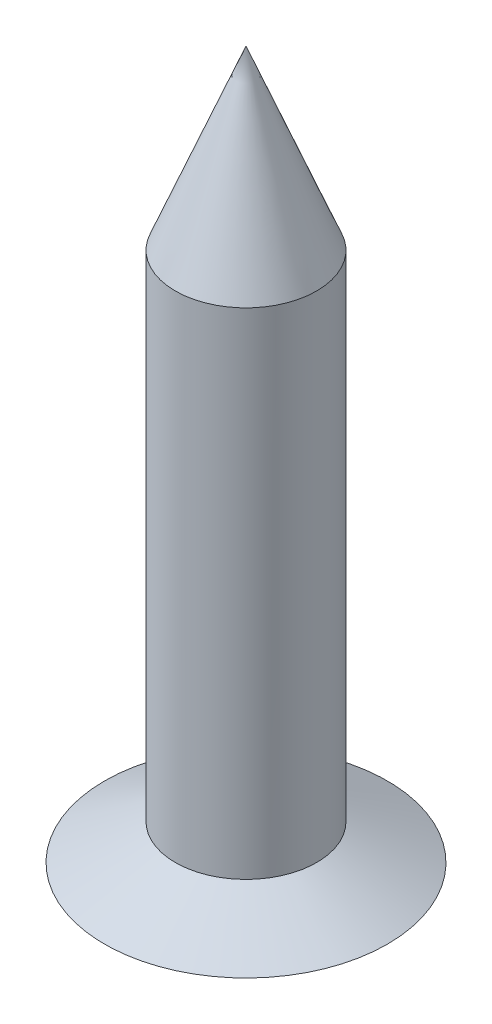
ISO-10303-21;
HEADER;
FILE_DESCRIPTION(('STEP AP214'),'2;1');
FILE_NAME('part.step','',(''),(''),'','','');
FILE_SCHEMA(('AUTOMOTIVE_DESIGN { 1 0 10303 214 1 1 1 1 }'));
ENDSEC;
DATA;
#1=APPLICATION_CONTEXT('core data for automotive mechanical design processes');
#2=APPLICATION_PROTOCOL_DEFINITION('international standard','automotive_design',2000,#1);
#3=PRODUCT_CONTEXT('',#1,'mechanical');
#4=PRODUCT('Part','Part','',(#3));
#5=PRODUCT_RELATED_PRODUCT_CATEGORY('part','',(#4));
#6=PRODUCT_DEFINITION_FORMATION('','',#4);
#7=PRODUCT_DEFINITION_CONTEXT('part definition',#1,'design');
#8=PRODUCT_DEFINITION('design','',#6,#7);
#9=PRODUCT_DEFINITION_SHAPE('','',#8);
#10=(LENGTH_UNIT() NAMED_UNIT(*) SI_UNIT(.MILLI.,.METRE.));
#11=(NAMED_UNIT(*) PLANE_ANGLE_UNIT() SI_UNIT($,.RADIAN.));
#12=(NAMED_UNIT(*) SI_UNIT($,.STERADIAN.) SOLID_ANGLE_UNIT());
#13=UNCERTAINTY_MEASURE_WITH_UNIT(LENGTH_MEASURE(1.E-05),#10,'distance_accuracy_value','');
#14=(GEOMETRIC_REPRESENTATION_CONTEXT(3) GLOBAL_UNCERTAINTY_ASSIGNED_CONTEXT((#13)) GLOBAL_UNIT_ASSIGNED_CONTEXT((#10,
#11,#12)) REPRESENTATION_CONTEXT('',''));
#15=CARTESIAN_POINT('',(0.,0.,0.));
#16=DIRECTION('',(0.,0.,1.));
#17=DIRECTION('',(1.,0.,0.));
#18=AXIS2_PLACEMENT_3D('',#15,#16,#17);
#19=CARTESIAN_POINT('',(0.,0.,0.));
#20=DIRECTION('',(0.,1.,0.));
#21=DIRECTION('',(-1.,0.,0.));
#22=AXIS2_PLACEMENT_3D('',#19,#20,#21);
#23=PLANE('',#22);
#24=CARTESIAN_POINT('',(0.,0.,0.));
#25=DIRECTION('',(0.,1.,0.));
#26=DIRECTION('',(-1.,0.,0.));
#27=AXIS2_PLACEMENT_3D('',#24,#25,#26);
#28=CIRCLE('',#27,4.);
#29=CARTESIAN_POINT('',(-4.,0.,0.));
#30=VERTEX_POINT('',#29);
#31=EDGE_CURVE('E11',#30,#30,#28,.T.);
#32=ORIENTED_EDGE('',*,*,#31,.F.);
#33=EDGE_LOOP('',(#32));
#34=FACE_BOUND('',#33,.T.);
#35=ADVANCED_FACE('F35',(#34),#23,.F.);
#36=CARTESIAN_POINT('',(0.,0.,0.));
#37=DIRECTION('',(0.,-1.,0.));
#38=DIRECTION('',(1.,0.,0.));
#39=AXIS2_PLACEMENT_3D('',#36,#37,#38);
#40=CONICAL_SURFACE('',#39,4.,1.10714871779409);
#41=CARTESIAN_POINT('',(0.,1.,0.));
#42=DIRECTION('',(0.,1.,0.));
#43=DIRECTION('',(-1.,0.,0.));
#44=AXIS2_PLACEMENT_3D('',#41,#42,#43);
#45=CIRCLE('',#44,2.);
#46=CARTESIAN_POINT('',(-2.,1.,0.));
#47=VERTEX_POINT('',#46);
#48=EDGE_CURVE('E41',#47,#47,#45,.T.);
#49=ORIENTED_EDGE('',*,*,#48,.F.);
#50=EDGE_LOOP('',(#49));
#51=FACE_BOUND('',#50,.T.);
#52=ORIENTED_EDGE('',*,*,#31,.T.);
#53=EDGE_LOOP('',(#52));
#54=FACE_BOUND('',#53,.T.);
#55=ADVANCED_FACE('F58',(#51,#54),#40,.T.);
#56=CARTESIAN_POINT('',(0.,20.,0.));
#57=DIRECTION('',(0.,1.,0.));
#58=DIRECTION('',(-1.,0.,0.));
#59=AXIS2_PLACEMENT_3D('',#56,#57,#58);
#60=CYLINDRICAL_SURFACE('',#59,2.);
#61=CARTESIAN_POINT('',(0.,15.,0.));
#62=DIRECTION('',(0.,1.,0.));
#63=DIRECTION('',(-1.,0.,0.));
#64=AXIS2_PLACEMENT_3D('',#61,#62,#63);
#65=CIRCLE('',#64,2.);
#66=CARTESIAN_POINT('',(-2.,15.,0.));
#67=VERTEX_POINT('',#66);
#68=EDGE_CURVE('E51',#67,#67,#65,.T.);
#69=ORIENTED_EDGE('',*,*,#68,.F.);
#70=EDGE_LOOP('',(#69));
#71=FACE_BOUND('',#70,.T.);
#72=ORIENTED_EDGE('',*,*,#48,.T.);
#73=EDGE_LOOP('',(#72));
#74=FACE_BOUND('',#73,.T.);
#75=ADVANCED_FACE('F47',(#71,#74),#60,.T.);
#76=CARTESIAN_POINT('',(0.,15.,0.));
#77=DIRECTION('',(0.,-1.,0.));
#78=DIRECTION('',(1.,0.,0.));
#79=AXIS2_PLACEMENT_3D('',#76,#77,#78);
#80=CONICAL_SURFACE('',#79,2.,0.380506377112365);
#81=CARTESIAN_POINT('',(0.,20.,0.));
#82=VERTEX_POINT('',#81);
#83=VERTEX_LOOP('',#82);
#84=FACE_BOUND('',#83,.T.);
#85=ORIENTED_EDGE('',*,*,#68,.T.);
#86=EDGE_LOOP('',(#85));
#87=FACE_BOUND('',#86,.T.);
#88=ADVANCED_FACE('F44',(#84,#87),#80,.T.);
#89=CLOSED_SHELL('',(#35,#55,#75,#88));
#90=MANIFOLD_SOLID_BREP('B2',#89);
#91=ADVANCED_BREP_SHAPE_REPRESENTATION('',(#18,#90),#14);
#92=SHAPE_DEFINITION_REPRESENTATION(#9,#91);
ENDSEC;
END-ISO-10303-21;
